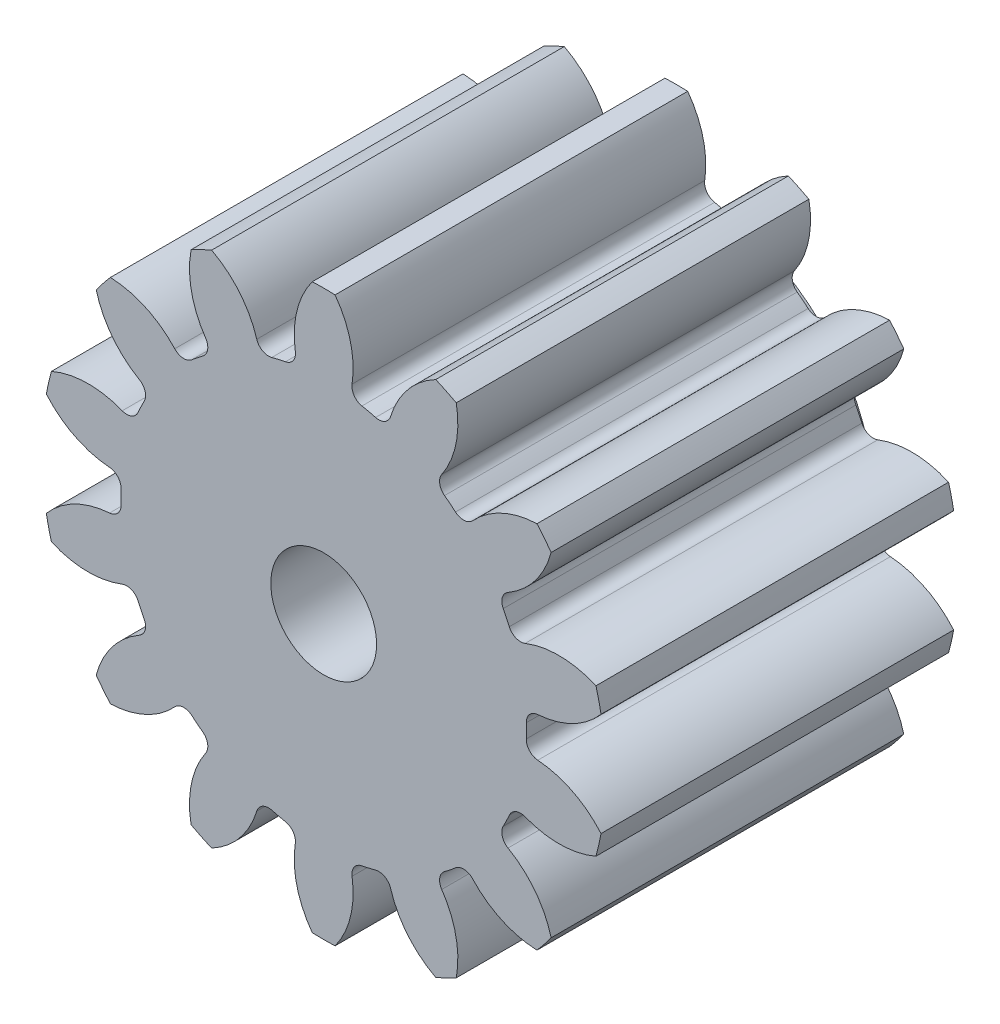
from build123d import *

# Parameters (mm, degrees)
ESQUISSE1_R                        = 2.5
BASE_EXTRUSION_DEPTH               = 0.3
BOSS_EXTRU_1_DEPTH                 = 5
CONG_1_R                           = 0.175
R_P_TITION_CIRCULAIRE4_COUNT       = 14
CONG_1_OF_R_P_TITION_CIRCULAIRE4_R = 0.175
ENL_V_MAT_EXTRU_1_REACH            = 9.717
ESQUISSE4_R                        = 0.75


with BuildPart() as part:
    # Esquisse1 → Base-Extrusion (new body)
    with BuildSketch(Plane.XY):
        Circle(ESQUISSE1_R)
    extrude(amount=BASE_EXTRUSION_DEPTH)

    # Esquisse3 → Boss.-Extru.1 (add)
    with BuildSketch(Plane.XY.offset(0.3)):
        with BuildLine():
            Line((-0.639747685, 2.802917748), (0, 0))
            Line((0, 0), (0.639747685, 2.802917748))
            ThreePointArc((0.639747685, 2.802917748), (0.50273931, 2.830702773), (0.364542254, 2.851794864))
            ThreePointArc((0.364542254, 2.851794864), (0.397531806, 3.448131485), (0.161451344, 3.996740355))
            ThreePointArc((0.161451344, 3.996740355), (0, 4), (-0.161451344, 3.996740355))
            ThreePointArc((-0.161451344, 3.996740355), (-0.397531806, 3.448131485), (-0.364542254, 2.851794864))
            ThreePointArc((-0.364542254, 2.851794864), (-0.50273931, 2.830702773), (-0.639747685, 2.802917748))
        make_face()
    boss_extru_1 = extrude(amount=BOSS_EXTRU_1_DEPTH)

    # Cong_1
    cong_1_edges = [part.edges().sort_by_distance(p)[0] for p in [
        (0.364542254, 2.851794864, 2.8),
        (-0.364542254, 2.851794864, 2.8),
    ]]
    fillet(cong_1_edges, radius=CONG_1_R)

    # R_p_tition circulaire4: Boss.-Extru.1 ×14 about axis
    r_p_tition_circulaire4_axis = Axis((0, 0, 0), (0, 0, 1))
    for i in range(1, R_P_TITION_CIRCULAIRE4_COUNT):
        add(boss_extru_1.rotate(r_p_tition_circulaire4_axis, i * 360 / R_P_TITION_CIRCULAIRE4_COUNT))

    # Cong_1 of R_p_tition circulaire4
    cong_1_of_r_p_tition_circulaire4_edges = [part.edges().sort_by_distance(p)[0] for p in [
        (-0.908906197, 2.727547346, 2.8),
        (-1.565788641, 2.411209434, 2.8),
        (-2.002334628, 2.063075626, 2.8),
        (-2.456911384, 1.493054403, 2.8),
        (-2.69917613, 0.989986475, 2.8),
        (-2.861412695, 0.279181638, 2.8),
        (-2.861412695, -0.279181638, 2.8),
        (-2.69917613, -0.989986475, 2.8),
        (-2.456911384, -1.493054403, 2.8),
        (-2.002334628, -2.063075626, 2.8),
        (-1.565788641, -2.411209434, 2.8),
        (-0.908906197, -2.727547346, 2.8),
        (-0.364542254, -2.851794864, 2.8),
        (0.364542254, -2.851794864, 2.8),
        (0.908906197, -2.727547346, 2.8),
        (1.565788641, -2.411209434, 2.8),
        (2.002334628, -2.063075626, 2.8),
        (2.456911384, -1.493054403, 2.8),
        (2.69917613, -0.989986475, 2.8),
        (2.861412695, -0.279181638, 2.8),
        (2.861412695, 0.279181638, 2.8),
        (2.69917613, 0.989986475, 2.8),
        (2.456911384, 1.493054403, 2.8),
        (2.002334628, 2.063075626, 2.8),
        (1.565788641, 2.411209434, 2.8),
        (0.908906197, 2.727547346, 2.8),
    ]]
    fillet(cong_1_of_r_p_tition_circulaire4_edges, radius=CONG_1_OF_R_P_TITION_CIRCULAIRE4_R)

    # Esquisse4 → Enl_v. mat.-Extru.1 (cut, up to next)
    with BuildSketch(Plane.XY.offset(5.3), mode=Mode.PRIVATE) as enl_v_mat_extru_1_sk1:
        Circle(ESQUISSE4_R)
    enl_v_mat_extru_1_tool1 = extrude(enl_v_mat_extru_1_sk1.sketch, amount=-ENL_V_MAT_EXTRU_1_REACH, mode=Mode.PRIVATE) & part.part
    add(enl_v_mat_extru_1_tool1.solids().sort_by_distance((0, 0, 5.3))[0], mode=Mode.SUBTRACT)


solid = part.part
